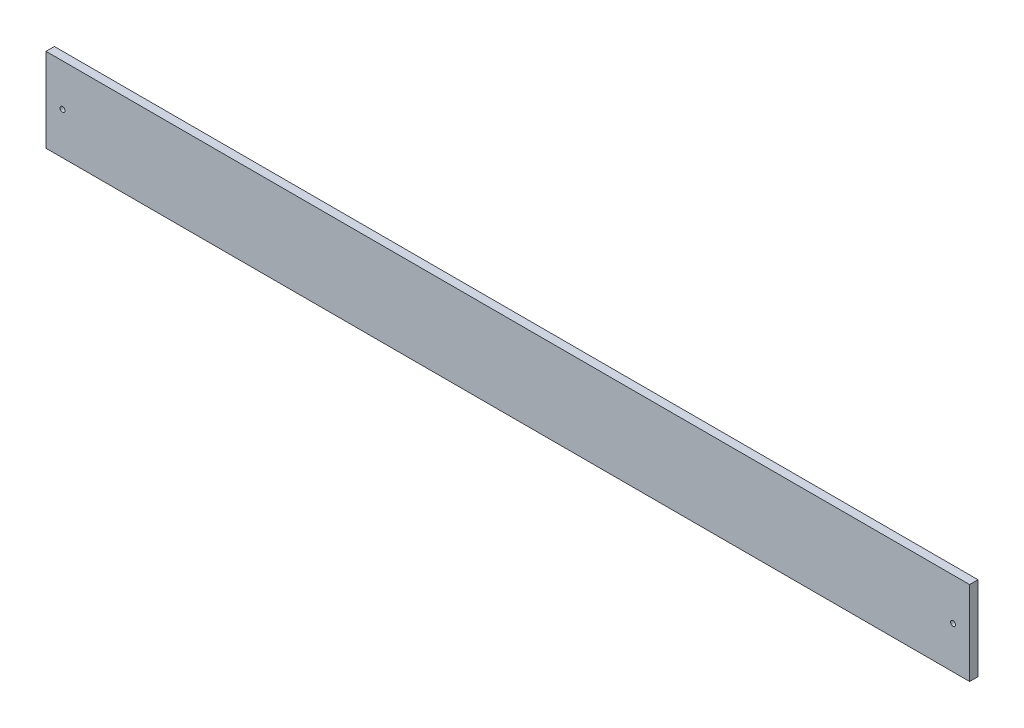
from build123d import *

# Parameters (mm, degrees)
SKETCH1_W           = 550
SKETCH1_H           = 50
BOSS_EXTRUDE1_DEPTH = 5
SKETCH2_R           = 1.5
CUT_EXTRUDE1_DEPTH  = 5


with BuildPart() as part:
    # Sketch1 → Boss-Extrude1 (new body)
    with BuildSketch(Plane.XY):
        Rectangle(SKETCH1_W, SKETCH1_H)
    extrude(amount=BOSS_EXTRUDE1_DEPTH)

    # Sketch2 → Cut-Extrude1 (cut)
    with BuildSketch(Plane.XY.offset(5)):
        with Locations((265.165, 0)):
            Circle(SKETCH2_R)
    cut_extrude1 = extrude(amount=-CUT_EXTRUDE1_DEPTH, mode=Mode.SUBTRACT)

    # Mirror1: Cut-Extrude1 across plane
    add(cut_extrude1.mirror(Plane(origin=(0, 0, 0), x_dir=(0, 0, 1), z_dir=(1, 0, 0))), mode=Mode.SUBTRACT)


solid = part.part
